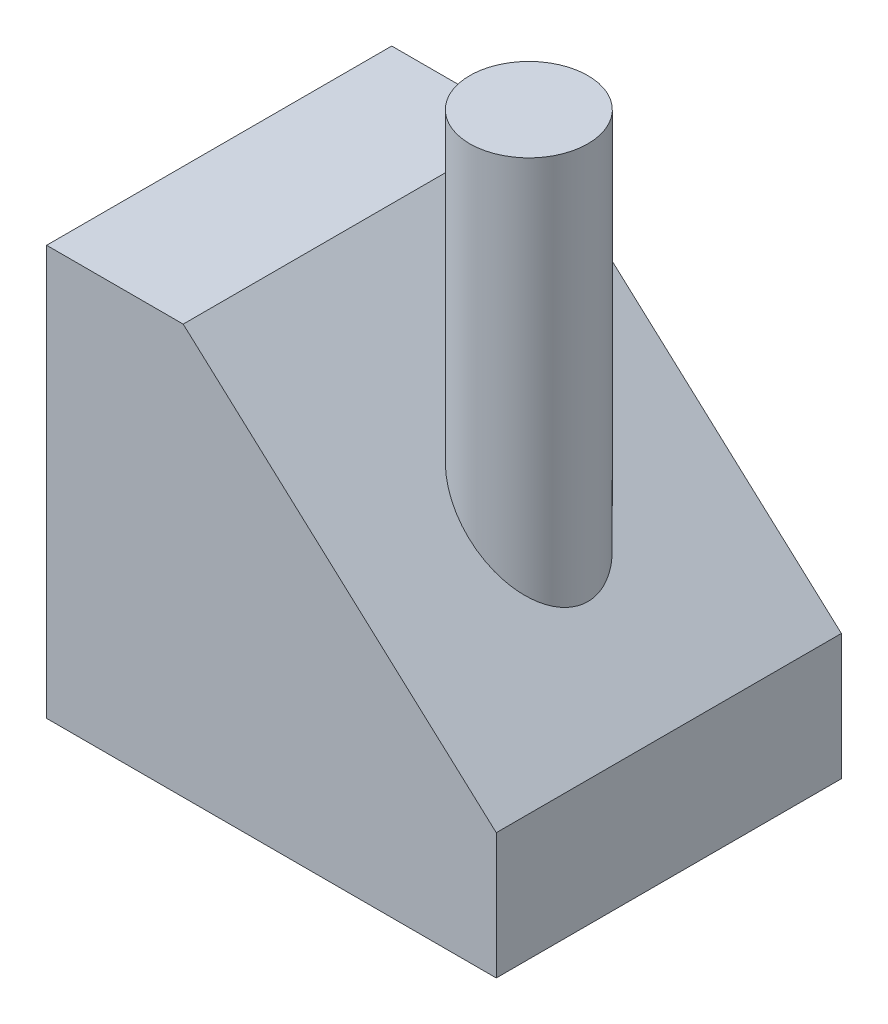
ISO-10303-21;
HEADER;
FILE_DESCRIPTION(('STEP AP214'),'2;1');
FILE_NAME('part.step','',(''),(''),'','','');
FILE_SCHEMA(('AUTOMOTIVE_DESIGN { 1 0 10303 214 1 1 1 1 }'));
ENDSEC;
DATA;
#1=APPLICATION_CONTEXT('core data for automotive mechanical design processes');
#2=APPLICATION_PROTOCOL_DEFINITION('international standard','automotive_design',2000,#1);
#3=PRODUCT_CONTEXT('',#1,'mechanical');
#4=PRODUCT('Part','Part','',(#3));
#5=PRODUCT_RELATED_PRODUCT_CATEGORY('part','',(#4));
#6=PRODUCT_DEFINITION_FORMATION('','',#4);
#7=PRODUCT_DEFINITION_CONTEXT('part definition',#1,'design');
#8=PRODUCT_DEFINITION('design','',#6,#7);
#9=PRODUCT_DEFINITION_SHAPE('','',#8);
#10=(LENGTH_UNIT() NAMED_UNIT(*) SI_UNIT(.MILLI.,.METRE.));
#11=(NAMED_UNIT(*) PLANE_ANGLE_UNIT() SI_UNIT($,.RADIAN.));
#12=(NAMED_UNIT(*) SI_UNIT($,.STERADIAN.) SOLID_ANGLE_UNIT());
#13=UNCERTAINTY_MEASURE_WITH_UNIT(LENGTH_MEASURE(1.E-05),#10,'distance_accuracy_value','');
#14=(GEOMETRIC_REPRESENTATION_CONTEXT(3) GLOBAL_UNCERTAINTY_ASSIGNED_CONTEXT((#13)) GLOBAL_UNIT_ASSIGNED_CONTEXT((#10,
#11,#12)) REPRESENTATION_CONTEXT('',''));
#15=CARTESIAN_POINT('',(0.,0.,0.));
#16=DIRECTION('',(0.,0.,1.));
#17=DIRECTION('',(1.,0.,0.));
#18=AXIS2_PLACEMENT_3D('',#15,#16,#17);
#19=CARTESIAN_POINT('',(109.444117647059,30.6294117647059,42.));
#20=DIRECTION('',(-0.671768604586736,-0.740761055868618,0.));
#21=DIRECTION('',(0.740761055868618,-0.671768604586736,0.));
#22=AXIS2_PLACEMENT_3D('',#19,#20,#21);
#23=PLANE('',#22);
#24=DIRECTION('',(-0.740761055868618,0.671768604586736,0.));
#25=VECTOR('',#24,1.);
#26=CARTESIAN_POINT('',(109.444117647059,30.6294117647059,-42.));
#27=LINE('',#26,#25);
#28=CARTESIAN_POINT('',(109.444117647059,30.6294117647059,-42.));
#29=VERTEX_POINT('',#28);
#30=CARTESIAN_POINT('',(33.2441176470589,99.7323529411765,-42.));
#31=VERTEX_POINT('',#30);
#32=EDGE_CURVE('E100',#29,#31,#27,.T.);
#33=ORIENTED_EDGE('',*,*,#32,.T.);
#34=DIRECTION('',(0.,0.,-1.));
#35=VECTOR('',#34,1.);
#36=CARTESIAN_POINT('',(33.2441176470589,99.7323529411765,42.));
#37=LINE('',#36,#35);
#38=CARTESIAN_POINT('',(33.2441176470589,99.7323529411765,42.));
#39=VERTEX_POINT('',#38);
#40=EDGE_CURVE('E112',#39,#31,#37,.T.);
#41=ORIENTED_EDGE('',*,*,#40,.F.);
#42=DIRECTION('',(-0.740761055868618,0.671768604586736,0.));
#43=VECTOR('',#42,1.);
#44=CARTESIAN_POINT('',(109.444117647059,30.6294117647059,42.));
#45=LINE('',#44,#43);
#46=CARTESIAN_POINT('',(109.444117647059,30.6294117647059,42.));
#47=VERTEX_POINT('',#46);
#48=EDGE_CURVE('E47',#47,#39,#45,.T.);
#49=ORIENTED_EDGE('',*,*,#48,.F.);
#50=DIRECTION('',(0.,0.,-1.));
#51=VECTOR('',#50,1.);
#52=CARTESIAN_POINT('',(109.444117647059,30.6294117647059,42.));
#53=LINE('',#52,#51);
#54=EDGE_CURVE('E115',#47,#29,#53,.T.);
#55=ORIENTED_EDGE('',*,*,#54,.T.);
#56=EDGE_LOOP('',(#33,#41,#49,#55));
#57=FACE_BOUND('',#56,.T.);
#58=CARTESIAN_POINT('',(75.3688249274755,61.5310252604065,0.));
#59=DIRECTION('',(-0.671768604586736,-0.740761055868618,0.));
#60=DIRECTION('',(0.740761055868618,-0.671768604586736,0.));
#61=AXIS2_PLACEMENT_3D('',#58,#59,#60);
#62=ELLIPSE('',#61,19.4138803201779,14.381046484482);
#63=CARTESIAN_POINT('',(89.7498714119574,48.4893899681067,0.));
#64=VERTEX_POINT('',#63);
#65=EDGE_CURVE('E11',#64,#64,#62,.F.);
#66=ORIENTED_EDGE('',*,*,#65,.F.);
#67=EDGE_LOOP('',(#66));
#68=FACE_BOUND('',#67,.T.);
#69=ADVANCED_FACE('F27',(#57,#68),#23,.F.);
#70=CARTESIAN_POINT('',(0.,99.7323529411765,42.));
#71=DIRECTION('',(1.,0.,0.));
#72=DIRECTION('',(0.,0.,-1.));
#73=AXIS2_PLACEMENT_3D('',#70,#71,#72);
#74=PLANE('',#73);
#75=DIRECTION('',(0.,-1.,0.));
#76=VECTOR('',#75,1.);
#77=CARTESIAN_POINT('',(0.,99.7323529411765,-42.));
#78=LINE('',#77,#76);
#79=CARTESIAN_POINT('',(0.,99.7323529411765,-42.));
#80=VERTEX_POINT('',#79);
#81=CARTESIAN_POINT('',(0.,0.,-42.));
#82=VERTEX_POINT('',#81);
#83=EDGE_CURVE('E79',#80,#82,#78,.T.);
#84=ORIENTED_EDGE('',*,*,#83,.T.);
#85=DIRECTION('',(0.,0.,-1.));
#86=VECTOR('',#85,1.);
#87=CARTESIAN_POINT('',(0.,0.,42.));
#88=LINE('',#87,#86);
#89=CARTESIAN_POINT('',(0.,0.,42.));
#90=VERTEX_POINT('',#89);
#91=EDGE_CURVE('E35',#90,#82,#88,.T.);
#92=ORIENTED_EDGE('',*,*,#91,.F.);
#93=DIRECTION('',(0.,-1.,0.));
#94=VECTOR('',#93,1.);
#95=CARTESIAN_POINT('',(0.,99.7323529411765,42.));
#96=LINE('',#95,#94);
#97=CARTESIAN_POINT('',(0.,99.7323529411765,42.));
#98=VERTEX_POINT('',#97);
#99=EDGE_CURVE('E104',#98,#90,#96,.T.);
#100=ORIENTED_EDGE('',*,*,#99,.F.);
#101=DIRECTION('',(0.,0.,-1.));
#102=VECTOR('',#101,1.);
#103=CARTESIAN_POINT('',(0.,99.7323529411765,42.));
#104=LINE('',#103,#102);
#105=EDGE_CURVE('E93',#98,#80,#104,.T.);
#106=ORIENTED_EDGE('',*,*,#105,.T.);
#107=EDGE_LOOP('',(#84,#92,#100,#106));
#108=FACE_BOUND('',#107,.T.);
#109=ADVANCED_FACE('F29',(#108),#74,.F.);
#110=CARTESIAN_POINT('',(0.,0.,42.));
#111=DIRECTION('',(0.,1.,0.));
#112=DIRECTION('',(0.,0.,1.));
#113=AXIS2_PLACEMENT_3D('',#110,#111,#112);
#114=PLANE('',#113);
#115=DIRECTION('',(1.,0.,0.));
#116=VECTOR('',#115,1.);
#117=CARTESIAN_POINT('',(0.,0.,-42.));
#118=LINE('',#117,#116);
#119=CARTESIAN_POINT('',(109.444117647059,0.,-42.));
#120=VERTEX_POINT('',#119);
#121=EDGE_CURVE('E74',#82,#120,#118,.T.);
#122=ORIENTED_EDGE('',*,*,#121,.T.);
#123=DIRECTION('',(0.,0.,-1.));
#124=VECTOR('',#123,1.);
#125=CARTESIAN_POINT('',(109.444117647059,0.,42.));
#126=LINE('',#125,#124);
#127=CARTESIAN_POINT('',(109.444117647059,0.,42.));
#128=VERTEX_POINT('',#127);
#129=EDGE_CURVE('E91',#128,#120,#126,.T.);
#130=ORIENTED_EDGE('',*,*,#129,.F.);
#131=DIRECTION('',(1.,0.,0.));
#132=VECTOR('',#131,1.);
#133=CARTESIAN_POINT('',(0.,0.,42.));
#134=LINE('',#133,#132);
#135=EDGE_CURVE('E88',#90,#128,#134,.T.);
#136=ORIENTED_EDGE('',*,*,#135,.F.);
#137=ORIENTED_EDGE('',*,*,#91,.T.);
#138=EDGE_LOOP('',(#122,#130,#136,#137));
#139=FACE_BOUND('',#138,.T.);
#140=ADVANCED_FACE('F87',(#139),#114,.F.);
#141=CARTESIAN_POINT('',(109.444117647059,0.,42.));
#142=DIRECTION('',(-1.,0.,0.));
#143=DIRECTION('',(0.,0.,1.));
#144=AXIS2_PLACEMENT_3D('',#141,#142,#143);
#145=PLANE('',#144);
#146=DIRECTION('',(0.,1.,0.));
#147=VECTOR('',#146,1.);
#148=CARTESIAN_POINT('',(109.444117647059,0.,-42.));
#149=LINE('',#148,#147);
#150=EDGE_CURVE('E81',#120,#29,#149,.T.);
#151=ORIENTED_EDGE('',*,*,#150,.T.);
#152=ORIENTED_EDGE('',*,*,#54,.F.);
#153=DIRECTION('',(0.,1.,0.));
#154=VECTOR('',#153,1.);
#155=CARTESIAN_POINT('',(109.444117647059,0.,42.));
#156=LINE('',#155,#154);
#157=EDGE_CURVE('E107',#128,#47,#156,.T.);
#158=ORIENTED_EDGE('',*,*,#157,.F.);
#159=ORIENTED_EDGE('',*,*,#129,.T.);
#160=EDGE_LOOP('',(#151,#152,#158,#159));
#161=FACE_BOUND('',#160,.T.);
#162=ADVANCED_FACE('F120',(#161),#145,.F.);
#163=CARTESIAN_POINT('',(33.2441176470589,99.7323529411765,42.));
#164=DIRECTION('',(0.,-1.,0.));
#165=DIRECTION('',(0.,0.,-1.));
#166=AXIS2_PLACEMENT_3D('',#163,#164,#165);
#167=PLANE('',#166);
#168=DIRECTION('',(-1.,0.,0.));
#169=VECTOR('',#168,1.);
#170=CARTESIAN_POINT('',(33.2441176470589,99.7323529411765,-42.));
#171=LINE('',#170,#169);
#172=EDGE_CURVE('E102',#31,#80,#171,.T.);
#173=ORIENTED_EDGE('',*,*,#172,.T.);
#174=ORIENTED_EDGE('',*,*,#105,.F.);
#175=DIRECTION('',(-1.,0.,0.));
#176=VECTOR('',#175,1.);
#177=CARTESIAN_POINT('',(33.2441176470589,99.7323529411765,42.));
#178=LINE('',#177,#176);
#179=EDGE_CURVE('E42',#39,#98,#178,.T.);
#180=ORIENTED_EDGE('',*,*,#179,.F.);
#181=ORIENTED_EDGE('',*,*,#40,.T.);
#182=EDGE_LOOP('',(#173,#174,#180,#181));
#183=FACE_BOUND('',#182,.T.);
#184=ADVANCED_FACE('F124',(#183),#167,.F.);
#185=CARTESIAN_POINT('',(0.,0.,42.));
#186=DIRECTION('',(0.,0.,1.));
#187=DIRECTION('',(1.,0.,0.));
#188=AXIS2_PLACEMENT_3D('',#185,#186,#187);
#189=PLANE('',#188);
#190=ORIENTED_EDGE('',*,*,#99,.T.);
#191=ORIENTED_EDGE('',*,*,#135,.T.);
#192=ORIENTED_EDGE('',*,*,#157,.T.);
#193=ORIENTED_EDGE('',*,*,#48,.T.);
#194=ORIENTED_EDGE('',*,*,#179,.T.);
#195=EDGE_LOOP('',(#190,#191,#192,#193,#194));
#196=FACE_BOUND('',#195,.T.);
#197=ADVANCED_FACE('F122',(#196),#189,.T.);
#198=CARTESIAN_POINT('',(0.,0.,-42.));
#199=DIRECTION('',(0.,0.,1.));
#200=DIRECTION('',(1.,0.,0.));
#201=AXIS2_PLACEMENT_3D('',#198,#199,#200);
#202=PLANE('',#201);
#203=ORIENTED_EDGE('',*,*,#83,.F.);
#204=ORIENTED_EDGE('',*,*,#172,.F.);
#205=ORIENTED_EDGE('',*,*,#32,.F.);
#206=ORIENTED_EDGE('',*,*,#150,.F.);
#207=ORIENTED_EDGE('',*,*,#121,.F.);
#208=EDGE_LOOP('',(#203,#204,#205,#206,#207));
#209=FACE_BOUND('',#208,.T.);
#210=ADVANCED_FACE('F76',(#209),#202,.F.);
#211=CARTESIAN_POINT('',(75.3688249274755,145.,0.));
#212=DIRECTION('',(0.,-1.,0.));
#213=DIRECTION('',(0.,0.,-1.));
#214=AXIS2_PLACEMENT_3D('',#211,#212,#213);
#215=CYLINDRICAL_SURFACE('',#214,14.381046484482);
#216=CARTESIAN_POINT('',(75.3688249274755,145.,0.));
#217=DIRECTION('',(0.,1.,0.));
#218=DIRECTION('',(0.,0.,1.));
#219=AXIS2_PLACEMENT_3D('',#216,#217,#218);
#220=CIRCLE('',#219,14.381046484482);
#221=CARTESIAN_POINT('',(75.3688249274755,145.,14.381046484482));
#222=VERTEX_POINT('',#221);
#223=EDGE_CURVE('E94',#222,#222,#220,.T.);
#224=ORIENTED_EDGE('',*,*,#223,.F.);
#225=EDGE_LOOP('',(#224));
#226=FACE_BOUND('',#225,.T.);
#227=ORIENTED_EDGE('',*,*,#65,.T.);
#228=EDGE_LOOP('',(#227));
#229=FACE_BOUND('',#228,.T.);
#230=ADVANCED_FACE('F130',(#226,#229),#215,.T.);
#231=CARTESIAN_POINT('',(75.3688249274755,145.,0.));
#232=DIRECTION('',(0.,1.,0.));
#233=DIRECTION('',(0.,0.,1.));
#234=AXIS2_PLACEMENT_3D('',#231,#232,#233);
#235=PLANE('',#234);
#236=ORIENTED_EDGE('',*,*,#223,.T.);
#237=EDGE_LOOP('',(#236));
#238=FACE_BOUND('',#237,.T.);
#239=ADVANCED_FACE('F154',(#238),#235,.T.);
#240=CLOSED_SHELL('',(#69,#109,#140,#162,#184,#197,#210,#230,#239));
#241=MANIFOLD_SOLID_BREP('B2',#240);
#242=ADVANCED_BREP_SHAPE_REPRESENTATION('',(#18,#241),#14);
#243=SHAPE_DEFINITION_REPRESENTATION(#9,#242);
ENDSEC;
END-ISO-10303-21;
